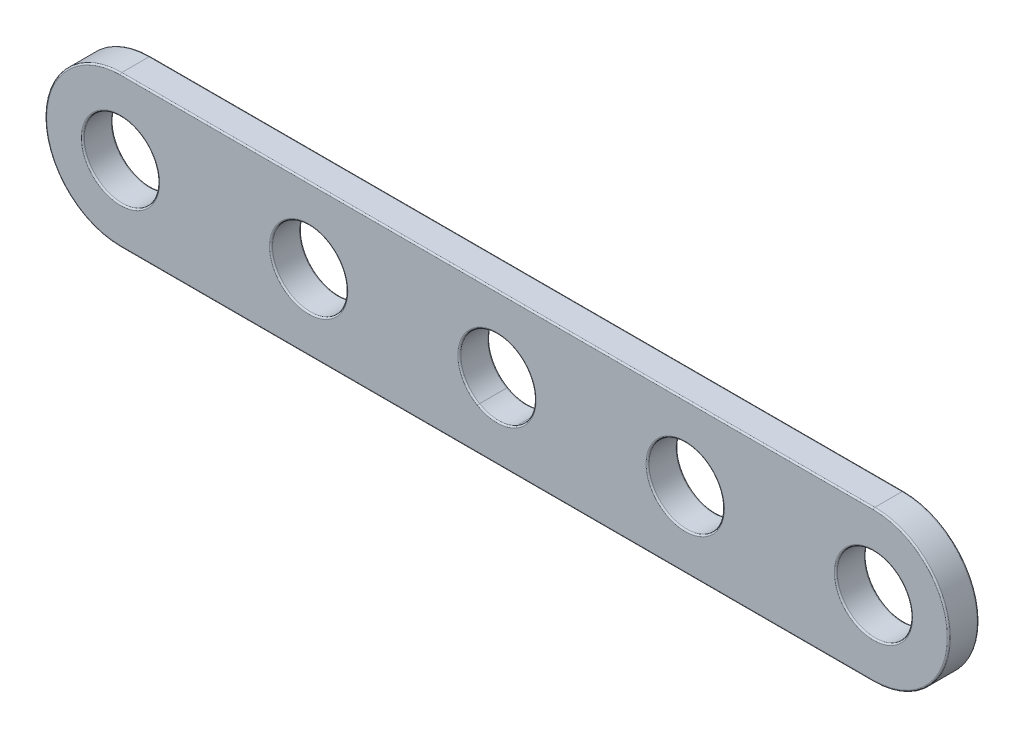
ISO-10303-21;
HEADER;
FILE_DESCRIPTION(('STEP AP214'),'2;1');
FILE_NAME('part.step','',(''),(''),'','','');
FILE_SCHEMA(('AUTOMOTIVE_DESIGN { 1 0 10303 214 1 1 1 1 }'));
ENDSEC;
DATA;
#1=APPLICATION_CONTEXT('core data for automotive mechanical design processes');
#2=APPLICATION_PROTOCOL_DEFINITION('international standard','automotive_design',2000,#1);
#3=PRODUCT_CONTEXT('',#1,'mechanical');
#4=PRODUCT('Part','Part','',(#3));
#5=PRODUCT_RELATED_PRODUCT_CATEGORY('part','',(#4));
#6=PRODUCT_DEFINITION_FORMATION('','',#4);
#7=PRODUCT_DEFINITION_CONTEXT('part definition',#1,'design');
#8=PRODUCT_DEFINITION('design','',#6,#7);
#9=PRODUCT_DEFINITION_SHAPE('','',#8);
#10=(LENGTH_UNIT() NAMED_UNIT(*) SI_UNIT(.MILLI.,.METRE.));
#11=(NAMED_UNIT(*) PLANE_ANGLE_UNIT() SI_UNIT($,.RADIAN.));
#12=(NAMED_UNIT(*) SI_UNIT($,.STERADIAN.) SOLID_ANGLE_UNIT());
#13=UNCERTAINTY_MEASURE_WITH_UNIT(LENGTH_MEASURE(1.E-05),#10,'distance_accuracy_value','');
#14=(GEOMETRIC_REPRESENTATION_CONTEXT(3) GLOBAL_UNCERTAINTY_ASSIGNED_CONTEXT((#13)) GLOBAL_UNIT_ASSIGNED_CONTEXT((#10,
#11,#12)) REPRESENTATION_CONTEXT('',''));
#15=CARTESIAN_POINT('',(0.,0.,0.));
#16=DIRECTION('',(0.,0.,1.));
#17=DIRECTION('',(1.,0.,0.));
#18=AXIS2_PLACEMENT_3D('',#15,#16,#17);
#19=CARTESIAN_POINT('',(250.,50.,0.));
#20=DIRECTION('',(0.,0.,1.));
#21=DIRECTION('',(1.,0.,0.));
#22=AXIS2_PLACEMENT_3D('',#19,#20,#21);
#23=CYLINDRICAL_SURFACE('',#22,25.);
#24=DIRECTION('',(0.,0.,1.));
#25=VECTOR('',#24,1.);
#26=CARTESIAN_POINT('',(262.5,28.349364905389,0.));
#27=LINE('',#26,#25);
#28=CARTESIAN_POINT('',(262.5,28.349364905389,19.));
#29=VERTEX_POINT('',#28);
#30=CARTESIAN_POINT('',(262.5,28.349364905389,1.));
#31=VERTEX_POINT('',#30);
#32=EDGE_CURVE('E343',#29,#31,#27,.F.);
#33=ORIENTED_EDGE('',*,*,#32,.F.);
#34=CARTESIAN_POINT('',(250.,50.,19.));
#35=DIRECTION('',(0.,0.,1.));
#36=DIRECTION('',(1.,0.,0.));
#37=AXIS2_PLACEMENT_3D('',#34,#35,#36);
#38=CIRCLE('',#37,25.);
#39=CARTESIAN_POINT('',(262.5,71.650635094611,19.));
#40=VERTEX_POINT('',#39);
#41=EDGE_CURVE('E236',#29,#40,#38,.T.);
#42=ORIENTED_EDGE('',*,*,#41,.T.);
#43=DIRECTION('',(0.,0.,1.));
#44=VECTOR('',#43,1.);
#45=CARTESIAN_POINT('',(262.5,71.650635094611,0.));
#46=LINE('',#45,#44);
#47=CARTESIAN_POINT('',(262.5,71.650635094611,1.));
#48=VERTEX_POINT('',#47);
#49=EDGE_CURVE('E337',#48,#40,#46,.T.);
#50=ORIENTED_EDGE('',*,*,#49,.F.);
#51=CARTESIAN_POINT('',(250.,50.,1.));
#52=DIRECTION('',(0.,0.,1.));
#53=DIRECTION('',(1.,0.,0.));
#54=AXIS2_PLACEMENT_3D('',#51,#52,#53);
#55=CIRCLE('',#54,25.);
#56=EDGE_CURVE('E233',#48,#31,#55,.F.);
#57=ORIENTED_EDGE('',*,*,#56,.T.);
#58=EDGE_LOOP('',(#33,#42,#50,#57));
#59=FACE_BOUND('',#58,.T.);
#60=ADVANCED_FACE('F36',(#59),#23,.F.);
#61=DIRECTION('',(0.,0.,1.));
#62=VECTOR('',#61,1.);
#63=CARTESIAN_POINT('',(237.5,28.349364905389,0.));
#64=LINE('',#63,#62);
#65=CARTESIAN_POINT('',(237.5,28.349364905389,1.));
#66=VERTEX_POINT('',#65);
#67=CARTESIAN_POINT('',(237.5,28.349364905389,19.));
#68=VERTEX_POINT('',#67);
#69=EDGE_CURVE('E331',#66,#68,#64,.T.);
#70=ORIENTED_EDGE('',*,*,#69,.T.);
#71=CARTESIAN_POINT('',(250.,50.,19.));
#72=DIRECTION('',(0.,0.,1.));
#73=DIRECTION('',(1.,0.,0.));
#74=AXIS2_PLACEMENT_3D('',#71,#72,#73);
#75=CIRCLE('',#74,25.);
#76=EDGE_CURVE('E231',#68,#29,#75,.T.);
#77=ORIENTED_EDGE('',*,*,#76,.T.);
#78=ORIENTED_EDGE('',*,*,#32,.T.);
#79=CARTESIAN_POINT('',(250.,50.,1.));
#80=DIRECTION('',(0.,0.,1.));
#81=DIRECTION('',(1.,0.,0.));
#82=AXIS2_PLACEMENT_3D('',#79,#80,#81);
#83=CIRCLE('',#82,25.);
#84=EDGE_CURVE('E229',#31,#66,#83,.F.);
#85=ORIENTED_EDGE('',*,*,#84,.T.);
#86=EDGE_LOOP('',(#70,#77,#78,#85));
#87=FACE_BOUND('',#86,.T.);
#88=ADVANCED_FACE('F365',(#87),#23,.F.);
#89=DIRECTION('',(0.,0.,1.));
#90=VECTOR('',#89,1.);
#91=CARTESIAN_POINT('',(237.5,71.650635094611,0.));
#92=LINE('',#91,#90);
#93=CARTESIAN_POINT('',(237.5,71.650635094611,19.));
#94=VERTEX_POINT('',#93);
#95=CARTESIAN_POINT('',(237.5,71.650635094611,1.));
#96=VERTEX_POINT('',#95);
#97=EDGE_CURVE('E329',#94,#96,#92,.F.);
#98=ORIENTED_EDGE('',*,*,#97,.F.);
#99=CARTESIAN_POINT('',(250.,50.,19.));
#100=DIRECTION('',(0.,0.,1.));
#101=DIRECTION('',(1.,0.,0.));
#102=AXIS2_PLACEMENT_3D('',#99,#100,#101);
#103=CIRCLE('',#102,25.);
#104=EDGE_CURVE('E157',#94,#68,#103,.T.);
#105=ORIENTED_EDGE('',*,*,#104,.T.);
#106=ORIENTED_EDGE('',*,*,#69,.F.);
#107=CARTESIAN_POINT('',(250.,50.,1.));
#108=DIRECTION('',(0.,0.,1.));
#109=DIRECTION('',(1.,0.,0.));
#110=AXIS2_PLACEMENT_3D('',#107,#108,#109);
#111=CIRCLE('',#110,25.);
#112=EDGE_CURVE('E226',#66,#96,#111,.F.);
#113=ORIENTED_EDGE('',*,*,#112,.T.);
#114=EDGE_LOOP('',(#98,#105,#106,#113));
#115=FACE_BOUND('',#114,.T.);
#116=ADVANCED_FACE('F328',(#115),#23,.F.);
#117=CARTESIAN_POINT('',(0.,50.,20.));
#118=DIRECTION('',(0.,0.,-1.));
#119=DIRECTION('',(-1.,0.,0.));
#120=AXIS2_PLACEMENT_3D('',#117,#118,#119);
#121=CYLINDRICAL_SURFACE('',#120,50.);
#122=DIRECTION('',(0.,0.,-1.));
#123=VECTOR('',#122,1.);
#124=CARTESIAN_POINT('',(0.,0.,20.));
#125=LINE('',#124,#123);
#126=CARTESIAN_POINT('',(0.,0.,19.));
#127=VERTEX_POINT('',#126);
#128=CARTESIAN_POINT('',(0.,0.,1.));
#129=VERTEX_POINT('',#128);
#130=EDGE_CURVE('E345',#127,#129,#125,.T.);
#131=ORIENTED_EDGE('',*,*,#130,.F.);
#132=CARTESIAN_POINT('',(0.,50.,19.));
#133=DIRECTION('',(0.,0.,1.));
#134=DIRECTION('',(1.,0.,0.));
#135=AXIS2_PLACEMENT_3D('',#132,#133,#134);
#136=CIRCLE('',#135,50.);
#137=CARTESIAN_POINT('',(0.,100.,19.));
#138=VERTEX_POINT('',#137);
#139=EDGE_CURVE('E212',#127,#138,#136,.F.);
#140=ORIENTED_EDGE('',*,*,#139,.T.);
#141=DIRECTION('',(0.,0.,-1.));
#142=VECTOR('',#141,1.);
#143=CARTESIAN_POINT('',(0.,100.,20.));
#144=LINE('',#143,#142);
#145=CARTESIAN_POINT('',(0.,100.,1.));
#146=VERTEX_POINT('',#145);
#147=EDGE_CURVE('E289',#138,#146,#144,.T.);
#148=ORIENTED_EDGE('',*,*,#147,.T.);
#149=CARTESIAN_POINT('',(0.,50.,1.));
#150=DIRECTION('',(0.,0.,1.));
#151=DIRECTION('',(1.,0.,0.));
#152=AXIS2_PLACEMENT_3D('',#149,#150,#151);
#153=CIRCLE('',#152,50.);
#154=EDGE_CURVE('E210',#146,#129,#153,.T.);
#155=ORIENTED_EDGE('',*,*,#154,.T.);
#156=EDGE_LOOP('',(#131,#140,#148,#155));
#157=FACE_BOUND('',#156,.T.);
#158=ADVANCED_FACE('F409',(#157),#121,.T.);
#159=CARTESIAN_POINT('',(0.,0.,20.));
#160=DIRECTION('',(0.,1.,0.));
#161=DIRECTION('',(0.,0.,1.));
#162=AXIS2_PLACEMENT_3D('',#159,#160,#161);
#163=PLANE('',#162);
#164=DIRECTION('',(0.,0.,-1.));
#165=VECTOR('',#164,1.);
#166=CARTESIAN_POINT('',(500.,0.,20.));
#167=LINE('',#166,#165);
#168=CARTESIAN_POINT('',(500.,0.,19.));
#169=VERTEX_POINT('',#168);
#170=CARTESIAN_POINT('',(500.,0.,1.));
#171=VERTEX_POINT('',#170);
#172=EDGE_CURVE('E717',#169,#171,#167,.T.);
#173=ORIENTED_EDGE('',*,*,#172,.F.);
#174=DIRECTION('',(1.,0.,0.));
#175=VECTOR('',#174,1.);
#176=CARTESIAN_POINT('',(0.,0.,19.));
#177=LINE('',#176,#175);
#178=EDGE_CURVE('E208',#169,#127,#177,.F.);
#179=ORIENTED_EDGE('',*,*,#178,.T.);
#180=ORIENTED_EDGE('',*,*,#130,.T.);
#181=DIRECTION('',(1.,0.,0.));
#182=VECTOR('',#181,1.);
#183=CARTESIAN_POINT('',(0.,0.,1.));
#184=LINE('',#183,#182);
#185=EDGE_CURVE('E205',#129,#171,#184,.T.);
#186=ORIENTED_EDGE('',*,*,#185,.T.);
#187=EDGE_LOOP('',(#173,#179,#180,#186));
#188=FACE_BOUND('',#187,.T.);
#189=ADVANCED_FACE('F413',(#188),#163,.F.);
#190=CARTESIAN_POINT('',(500.,50.,20.));
#191=DIRECTION('',(0.,0.,-1.));
#192=DIRECTION('',(-1.,0.,0.));
#193=AXIS2_PLACEMENT_3D('',#190,#191,#192);
#194=CYLINDRICAL_SURFACE('',#193,50.);
#195=DIRECTION('',(0.,0.,-1.));
#196=VECTOR('',#195,1.);
#197=CARTESIAN_POINT('',(500.,100.,20.));
#198=LINE('',#197,#196);
#199=CARTESIAN_POINT('',(500.,100.,19.));
#200=VERTEX_POINT('',#199);
#201=CARTESIAN_POINT('',(500.,100.,1.));
#202=VERTEX_POINT('',#201);
#203=EDGE_CURVE('E711',#200,#202,#198,.T.);
#204=ORIENTED_EDGE('',*,*,#203,.F.);
#205=CARTESIAN_POINT('',(500.,50.,19.));
#206=DIRECTION('',(0.,0.,1.));
#207=DIRECTION('',(1.,0.,0.));
#208=AXIS2_PLACEMENT_3D('',#205,#206,#207);
#209=CIRCLE('',#208,50.);
#210=EDGE_CURVE('E203',#200,#169,#209,.F.);
#211=ORIENTED_EDGE('',*,*,#210,.T.);
#212=ORIENTED_EDGE('',*,*,#172,.T.);
#213=CARTESIAN_POINT('',(500.,50.,1.));
#214=DIRECTION('',(0.,0.,1.));
#215=DIRECTION('',(1.,0.,0.));
#216=AXIS2_PLACEMENT_3D('',#213,#214,#215);
#217=CIRCLE('',#216,50.);
#218=EDGE_CURVE('E201',#171,#202,#217,.T.);
#219=ORIENTED_EDGE('',*,*,#218,.T.);
#220=EDGE_LOOP('',(#204,#211,#212,#219));
#221=FACE_BOUND('',#220,.T.);
#222=ADVANCED_FACE('F419',(#221),#194,.T.);
#223=CARTESIAN_POINT('',(0.,100.,20.));
#224=DIRECTION('',(0.,-1.,0.));
#225=DIRECTION('',(0.,0.,-1.));
#226=AXIS2_PLACEMENT_3D('',#223,#224,#225);
#227=PLANE('',#226);
#228=ORIENTED_EDGE('',*,*,#147,.F.);
#229=DIRECTION('',(-1.,0.,0.));
#230=VECTOR('',#229,1.);
#231=CARTESIAN_POINT('',(500.,100.,19.));
#232=LINE('',#231,#230);
#233=EDGE_CURVE('E198',#138,#200,#232,.F.);
#234=ORIENTED_EDGE('',*,*,#233,.T.);
#235=ORIENTED_EDGE('',*,*,#203,.T.);
#236=DIRECTION('',(-1.,0.,0.));
#237=VECTOR('',#236,1.);
#238=CARTESIAN_POINT('',(0.,100.,1.));
#239=LINE('',#238,#237);
#240=EDGE_CURVE('E196',#202,#146,#239,.T.);
#241=ORIENTED_EDGE('',*,*,#240,.T.);
#242=EDGE_LOOP('',(#228,#234,#235,#241));
#243=FACE_BOUND('',#242,.T.);
#244=ADVANCED_FACE('F675',(#243),#227,.F.);
#245=CARTESIAN_POINT('',(0.,50.,20.));
#246=DIRECTION('',(0.,0.,1.));
#247=DIRECTION('',(1.,0.,0.));
#248=AXIS2_PLACEMENT_3D('',#245,#246,#247);
#249=PLANE('',#248);
#250=CARTESIAN_POINT('',(500.,50.,20.));
#251=DIRECTION('',(0.,0.,1.));
#252=DIRECTION('',(1.,0.,0.));
#253=AXIS2_PLACEMENT_3D('',#250,#251,#252);
#254=CIRCLE('',#253,49.);
#255=CARTESIAN_POINT('',(500.,1.,20.));
#256=VERTEX_POINT('',#255);
#257=CARTESIAN_POINT('',(500.,99.,20.));
#258=VERTEX_POINT('',#257);
#259=EDGE_CURVE('E191',#256,#258,#254,.T.);
#260=ORIENTED_EDGE('',*,*,#259,.T.);
#261=DIRECTION('',(-1.,0.,0.));
#262=VECTOR('',#261,1.);
#263=CARTESIAN_POINT('',(0.,99.,20.));
#264=LINE('',#263,#262);
#265=CARTESIAN_POINT('',(0.,99.,20.));
#266=VERTEX_POINT('',#265);
#267=EDGE_CURVE('E193',#258,#266,#264,.T.);
#268=ORIENTED_EDGE('',*,*,#267,.T.);
#269=CARTESIAN_POINT('',(0.,50.,20.));
#270=DIRECTION('',(0.,0.,1.));
#271=DIRECTION('',(1.,0.,0.));
#272=AXIS2_PLACEMENT_3D('',#269,#270,#271);
#273=CIRCLE('',#272,49.);
#274=CARTESIAN_POINT('',(0.,1.,20.));
#275=VERTEX_POINT('',#274);
#276=EDGE_CURVE('E187',#266,#275,#273,.T.);
#277=ORIENTED_EDGE('',*,*,#276,.T.);
#278=DIRECTION('',(1.,0.,0.));
#279=VECTOR('',#278,1.);
#280=CARTESIAN_POINT('',(500.,1.,20.));
#281=LINE('',#280,#279);
#282=EDGE_CURVE('E189',#275,#256,#281,.T.);
#283=ORIENTED_EDGE('',*,*,#282,.T.);
#284=EDGE_LOOP('',(#260,#268,#277,#283));
#285=FACE_BOUND('',#284,.T.);
#286=CARTESIAN_POINT('',(0.,50.,20.));
#287=DIRECTION('',(0.,0.,1.));
#288=DIRECTION('',(1.,0.,0.));
#289=AXIS2_PLACEMENT_3D('',#286,#287,#288);
#290=CIRCLE('',#289,26.);
#291=CARTESIAN_POINT('',(26.,50.,20.));
#292=VERTEX_POINT('',#291);
#293=EDGE_CURVE('E180',#292,#292,#290,.F.);
#294=ORIENTED_EDGE('',*,*,#293,.T.);
#295=EDGE_LOOP('',(#294));
#296=FACE_BOUND('',#295,.T.);
#297=CARTESIAN_POINT('',(125.,50.,20.));
#298=DIRECTION('',(0.,0.,1.));
#299=DIRECTION('',(1.,0.,0.));
#300=AXIS2_PLACEMENT_3D('',#297,#298,#299);
#301=CIRCLE('',#300,26.);
#302=CARTESIAN_POINT('',(151.,50.,20.));
#303=VERTEX_POINT('',#302);
#304=EDGE_CURVE('E177',#303,#303,#301,.F.);
#305=ORIENTED_EDGE('',*,*,#304,.T.);
#306=EDGE_LOOP('',(#305));
#307=FACE_BOUND('',#306,.T.);
#308=CARTESIAN_POINT('',(250.,50.,20.));
#309=DIRECTION('',(0.,0.,1.));
#310=DIRECTION('',(1.,0.,0.));
#311=AXIS2_PLACEMENT_3D('',#308,#309,#310);
#312=CIRCLE('',#311,26.);
#313=CARTESIAN_POINT('',(263.,27.4833395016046,20.));
#314=VERTEX_POINT('',#313);
#315=CARTESIAN_POINT('',(237.,27.4833395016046,20.));
#316=VERTEX_POINT('',#315);
#317=EDGE_CURVE('E176',#314,#316,#312,.F.);
#318=ORIENTED_EDGE('',*,*,#317,.T.);
#319=CARTESIAN_POINT('',(250.,50.,20.));
#320=DIRECTION('',(0.,0.,1.));
#321=DIRECTION('',(1.,0.,0.));
#322=AXIS2_PLACEMENT_3D('',#319,#320,#321);
#323=CIRCLE('',#322,26.);
#324=CARTESIAN_POINT('',(237.,72.5166604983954,20.));
#325=VERTEX_POINT('',#324);
#326=EDGE_CURVE('E154',#316,#325,#323,.F.);
#327=ORIENTED_EDGE('',*,*,#326,.T.);
#328=CARTESIAN_POINT('',(250.,50.,20.));
#329=DIRECTION('',(0.,0.,1.));
#330=DIRECTION('',(1.,0.,0.));
#331=AXIS2_PLACEMENT_3D('',#328,#329,#330);
#332=CIRCLE('',#331,26.);
#333=CARTESIAN_POINT('',(263.,72.5166604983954,20.));
#334=VERTEX_POINT('',#333);
#335=EDGE_CURVE('E164',#325,#334,#332,.F.);
#336=ORIENTED_EDGE('',*,*,#335,.T.);
#337=CARTESIAN_POINT('',(250.,50.,20.));
#338=DIRECTION('',(0.,0.,1.));
#339=DIRECTION('',(1.,0.,0.));
#340=AXIS2_PLACEMENT_3D('',#337,#338,#339);
#341=CIRCLE('',#340,26.);
#342=EDGE_CURVE('E170',#334,#314,#341,.F.);
#343=ORIENTED_EDGE('',*,*,#342,.T.);
#344=EDGE_LOOP('',(#318,#327,#336,#343));
#345=FACE_BOUND('',#344,.T.);
#346=CARTESIAN_POINT('',(375.,50.,20.));
#347=DIRECTION('',(0.,0.,1.));
#348=DIRECTION('',(1.,0.,0.));
#349=AXIS2_PLACEMENT_3D('',#346,#347,#348);
#350=CIRCLE('',#349,26.);
#351=CARTESIAN_POINT('',(401.,50.,20.));
#352=VERTEX_POINT('',#351);
#353=EDGE_CURVE('E171',#352,#352,#350,.F.);
#354=ORIENTED_EDGE('',*,*,#353,.T.);
#355=EDGE_LOOP('',(#354));
#356=FACE_BOUND('',#355,.T.);
#357=CARTESIAN_POINT('',(500.,50.,20.));
#358=DIRECTION('',(0.,0.,1.));
#359=DIRECTION('',(1.,0.,0.));
#360=AXIS2_PLACEMENT_3D('',#357,#358,#359);
#361=CIRCLE('',#360,26.);
#362=CARTESIAN_POINT('',(526.,50.,20.));
#363=VERTEX_POINT('',#362);
#364=EDGE_CURVE('E352',#363,#363,#361,.F.);
#365=ORIENTED_EDGE('',*,*,#364,.T.);
#366=EDGE_LOOP('',(#365));
#367=FACE_BOUND('',#366,.T.);
#368=ADVANCED_FACE('F173',(#285,#296,#307,#345,#356,#367),#249,.T.);
#369=CARTESIAN_POINT('',(0.,50.,0.));
#370=DIRECTION('',(0.,0.,1.));
#371=DIRECTION('',(1.,0.,0.));
#372=AXIS2_PLACEMENT_3D('',#369,#370,#371);
#373=PLANE('',#372);
#374=CARTESIAN_POINT('',(500.,50.,0.));
#375=DIRECTION('',(0.,0.,1.));
#376=DIRECTION('',(1.,0.,0.));
#377=AXIS2_PLACEMENT_3D('',#374,#375,#376);
#378=CIRCLE('',#377,49.);
#379=CARTESIAN_POINT('',(500.,99.,0.));
#380=VERTEX_POINT('',#379);
#381=CARTESIAN_POINT('',(500.,1.,0.));
#382=VERTEX_POINT('',#381);
#383=EDGE_CURVE('E45',#380,#382,#378,.F.);
#384=ORIENTED_EDGE('',*,*,#383,.T.);
#385=DIRECTION('',(1.,0.,0.));
#386=VECTOR('',#385,1.);
#387=CARTESIAN_POINT('',(0.,1.,0.));
#388=LINE('',#387,#386);
#389=CARTESIAN_POINT('',(0.,1.,0.));
#390=VERTEX_POINT('',#389);
#391=EDGE_CURVE('E12',#382,#390,#388,.F.);
#392=ORIENTED_EDGE('',*,*,#391,.T.);
#393=CARTESIAN_POINT('',(0.,50.,0.));
#394=DIRECTION('',(0.,0.,1.));
#395=DIRECTION('',(1.,0.,0.));
#396=AXIS2_PLACEMENT_3D('',#393,#394,#395);
#397=CIRCLE('',#396,49.);
#398=CARTESIAN_POINT('',(0.,99.,0.));
#399=VERTEX_POINT('',#398);
#400=EDGE_CURVE('E275',#390,#399,#397,.F.);
#401=ORIENTED_EDGE('',*,*,#400,.T.);
#402=DIRECTION('',(-1.,0.,0.));
#403=VECTOR('',#402,1.);
#404=CARTESIAN_POINT('',(0.,99.,0.));
#405=LINE('',#404,#403);
#406=EDGE_CURVE('E56',#399,#380,#405,.F.);
#407=ORIENTED_EDGE('',*,*,#406,.T.);
#408=EDGE_LOOP('',(#384,#392,#401,#407));
#409=FACE_BOUND('',#408,.T.);
#410=CARTESIAN_POINT('',(0.,50.,0.));
#411=DIRECTION('',(0.,0.,1.));
#412=DIRECTION('',(1.,0.,0.));
#413=AXIS2_PLACEMENT_3D('',#410,#411,#412);
#414=CIRCLE('',#413,26.);
#415=CARTESIAN_POINT('',(26.,50.,0.));
#416=VERTEX_POINT('',#415);
#417=EDGE_CURVE('E272',#416,#416,#414,.T.);
#418=ORIENTED_EDGE('',*,*,#417,.T.);
#419=EDGE_LOOP('',(#418));
#420=FACE_BOUND('',#419,.T.);
#421=CARTESIAN_POINT('',(125.,50.,0.));
#422=DIRECTION('',(0.,0.,1.));
#423=DIRECTION('',(1.,0.,0.));
#424=AXIS2_PLACEMENT_3D('',#421,#422,#423);
#425=CIRCLE('',#424,26.);
#426=CARTESIAN_POINT('',(151.,50.,0.));
#427=VERTEX_POINT('',#426);
#428=EDGE_CURVE('E269',#427,#427,#425,.T.);
#429=ORIENTED_EDGE('',*,*,#428,.T.);
#430=EDGE_LOOP('',(#429));
#431=FACE_BOUND('',#430,.T.);
#432=CARTESIAN_POINT('',(250.,50.,0.));
#433=DIRECTION('',(0.,0.,1.));
#434=DIRECTION('',(1.,0.,0.));
#435=AXIS2_PLACEMENT_3D('',#432,#433,#434);
#436=CIRCLE('',#435,26.);
#437=CARTESIAN_POINT('',(237.,27.4833395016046,0.));
#438=VERTEX_POINT('',#437);
#439=CARTESIAN_POINT('',(263.,27.4833395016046,0.));
#440=VERTEX_POINT('',#439);
#441=EDGE_CURVE('E264',#438,#440,#436,.T.);
#442=ORIENTED_EDGE('',*,*,#441,.T.);
#443=CARTESIAN_POINT('',(250.,50.,0.));
#444=DIRECTION('',(0.,0.,1.));
#445=DIRECTION('',(1.,0.,0.));
#446=AXIS2_PLACEMENT_3D('',#443,#444,#445);
#447=CIRCLE('',#446,26.);
#448=CARTESIAN_POINT('',(263.,72.5166604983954,0.));
#449=VERTEX_POINT('',#448);
#450=EDGE_CURVE('E266',#440,#449,#447,.T.);
#451=ORIENTED_EDGE('',*,*,#450,.T.);
#452=CARTESIAN_POINT('',(250.,50.,0.));
#453=DIRECTION('',(0.,0.,1.));
#454=DIRECTION('',(1.,0.,0.));
#455=AXIS2_PLACEMENT_3D('',#452,#453,#454);
#456=CIRCLE('',#455,26.);
#457=CARTESIAN_POINT('',(237.,72.5166604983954,0.));
#458=VERTEX_POINT('',#457);
#459=EDGE_CURVE('E260',#449,#458,#456,.T.);
#460=ORIENTED_EDGE('',*,*,#459,.T.);
#461=CARTESIAN_POINT('',(250.,50.,0.));
#462=DIRECTION('',(0.,0.,1.));
#463=DIRECTION('',(1.,0.,0.));
#464=AXIS2_PLACEMENT_3D('',#461,#462,#463);
#465=CIRCLE('',#464,26.);
#466=EDGE_CURVE('E262',#458,#438,#465,.T.);
#467=ORIENTED_EDGE('',*,*,#466,.T.);
#468=EDGE_LOOP('',(#442,#451,#460,#467));
#469=FACE_BOUND('',#468,.T.);
#470=CARTESIAN_POINT('',(375.,50.,0.));
#471=DIRECTION('',(0.,0.,1.));
#472=DIRECTION('',(1.,0.,0.));
#473=AXIS2_PLACEMENT_3D('',#470,#471,#472);
#474=CIRCLE('',#473,26.);
#475=CARTESIAN_POINT('',(401.,50.,0.));
#476=VERTEX_POINT('',#475);
#477=EDGE_CURVE('E257',#476,#476,#474,.T.);
#478=ORIENTED_EDGE('',*,*,#477,.T.);
#479=EDGE_LOOP('',(#478));
#480=FACE_BOUND('',#479,.T.);
#481=CARTESIAN_POINT('',(500.,50.,0.));
#482=DIRECTION('',(0.,0.,1.));
#483=DIRECTION('',(1.,0.,0.));
#484=AXIS2_PLACEMENT_3D('',#481,#482,#483);
#485=CIRCLE('',#484,26.);
#486=CARTESIAN_POINT('',(526.,50.,0.));
#487=VERTEX_POINT('',#486);
#488=EDGE_CURVE('E254',#487,#487,#485,.T.);
#489=ORIENTED_EDGE('',*,*,#488,.T.);
#490=EDGE_LOOP('',(#489));
#491=FACE_BOUND('',#490,.T.);
#492=ADVANCED_FACE('F374',(#409,#420,#431,#469,#480,#491),#373,.F.);
#493=CARTESIAN_POINT('',(0.,50.,0.));
#494=DIRECTION('',(0.,0.,1.));
#495=DIRECTION('',(1.,0.,0.));
#496=AXIS2_PLACEMENT_3D('',#493,#494,#495);
#497=CYLINDRICAL_SURFACE('',#496,25.);
#498=CARTESIAN_POINT('',(0.,50.,19.));
#499=DIRECTION('',(0.,0.,1.));
#500=DIRECTION('',(1.,0.,0.));
#501=AXIS2_PLACEMENT_3D('',#498,#499,#500);
#502=CIRCLE('',#501,25.);
#503=CARTESIAN_POINT('',(25.,50.,19.));
#504=VERTEX_POINT('',#503);
#505=EDGE_CURVE('E217',#504,#504,#502,.T.);
#506=ORIENTED_EDGE('',*,*,#505,.T.);
#507=EDGE_LOOP('',(#506));
#508=FACE_BOUND('',#507,.T.);
#509=CARTESIAN_POINT('',(0.,50.,1.));
#510=DIRECTION('',(0.,0.,1.));
#511=DIRECTION('',(1.,0.,0.));
#512=AXIS2_PLACEMENT_3D('',#509,#510,#511);
#513=CIRCLE('',#512,25.);
#514=CARTESIAN_POINT('',(25.,50.,1.));
#515=VERTEX_POINT('',#514);
#516=EDGE_CURVE('E214',#515,#515,#513,.F.);
#517=ORIENTED_EDGE('',*,*,#516,.T.);
#518=EDGE_LOOP('',(#517));
#519=FACE_BOUND('',#518,.T.);
#520=ADVANCED_FACE('F377',(#508,#519),#497,.F.);
#521=CARTESIAN_POINT('',(125.,50.,0.));
#522=DIRECTION('',(0.,0.,1.));
#523=DIRECTION('',(1.,0.,0.));
#524=AXIS2_PLACEMENT_3D('',#521,#522,#523);
#525=CYLINDRICAL_SURFACE('',#524,25.);
#526=CARTESIAN_POINT('',(125.,50.,19.));
#527=DIRECTION('',(0.,0.,1.));
#528=DIRECTION('',(1.,0.,0.));
#529=AXIS2_PLACEMENT_3D('',#526,#527,#528);
#530=CIRCLE('',#529,25.);
#531=CARTESIAN_POINT('',(150.,50.,19.));
#532=VERTEX_POINT('',#531);
#533=EDGE_CURVE('E223',#532,#532,#530,.T.);
#534=ORIENTED_EDGE('',*,*,#533,.T.);
#535=EDGE_LOOP('',(#534));
#536=FACE_BOUND('',#535,.T.);
#537=CARTESIAN_POINT('',(125.,50.,1.));
#538=DIRECTION('',(0.,0.,1.));
#539=DIRECTION('',(1.,0.,0.));
#540=AXIS2_PLACEMENT_3D('',#537,#538,#539);
#541=CIRCLE('',#540,25.);
#542=CARTESIAN_POINT('',(150.,50.,1.));
#543=VERTEX_POINT('',#542);
#544=EDGE_CURVE('E220',#543,#543,#541,.F.);
#545=ORIENTED_EDGE('',*,*,#544,.T.);
#546=EDGE_LOOP('',(#545));
#547=FACE_BOUND('',#546,.T.);
#548=ADVANCED_FACE('F400',(#536,#547),#525,.F.);
#549=ORIENTED_EDGE('',*,*,#49,.T.);
#550=CARTESIAN_POINT('',(250.,50.,19.));
#551=DIRECTION('',(0.,0.,1.));
#552=DIRECTION('',(1.,0.,0.));
#553=AXIS2_PLACEMENT_3D('',#550,#551,#552);
#554=CIRCLE('',#553,25.);
#555=EDGE_CURVE('E240',#40,#94,#554,.T.);
#556=ORIENTED_EDGE('',*,*,#555,.T.);
#557=ORIENTED_EDGE('',*,*,#97,.T.);
#558=CARTESIAN_POINT('',(250.,50.,1.));
#559=DIRECTION('',(0.,0.,1.));
#560=DIRECTION('',(1.,0.,0.));
#561=AXIS2_PLACEMENT_3D('',#558,#559,#560);
#562=CIRCLE('',#561,25.);
#563=EDGE_CURVE('E238',#96,#48,#562,.F.);
#564=ORIENTED_EDGE('',*,*,#563,.T.);
#565=EDGE_LOOP('',(#549,#556,#557,#564));
#566=FACE_BOUND('',#565,.T.);
#567=ADVANCED_FACE('F334',(#566),#23,.F.);
#568=CARTESIAN_POINT('',(375.,50.,0.));
#569=DIRECTION('',(0.,0.,1.));
#570=DIRECTION('',(1.,0.,0.));
#571=AXIS2_PLACEMENT_3D('',#568,#569,#570);
#572=CYLINDRICAL_SURFACE('',#571,25.);
#573=CARTESIAN_POINT('',(375.,50.,19.));
#574=DIRECTION('',(0.,0.,1.));
#575=DIRECTION('',(1.,0.,0.));
#576=AXIS2_PLACEMENT_3D('',#573,#574,#575);
#577=CIRCLE('',#576,25.);
#578=CARTESIAN_POINT('',(400.,50.,19.));
#579=VERTEX_POINT('',#578);
#580=EDGE_CURVE('E245',#579,#579,#577,.T.);
#581=ORIENTED_EDGE('',*,*,#580,.T.);
#582=EDGE_LOOP('',(#581));
#583=FACE_BOUND('',#582,.T.);
#584=CARTESIAN_POINT('',(375.,50.,1.));
#585=DIRECTION('',(0.,0.,1.));
#586=DIRECTION('',(1.,0.,0.));
#587=AXIS2_PLACEMENT_3D('',#584,#585,#586);
#588=CIRCLE('',#587,25.);
#589=CARTESIAN_POINT('',(400.,50.,1.));
#590=VERTEX_POINT('',#589);
#591=EDGE_CURVE('E242',#590,#590,#588,.F.);
#592=ORIENTED_EDGE('',*,*,#591,.T.);
#593=EDGE_LOOP('',(#592));
#594=FACE_BOUND('',#593,.T.);
#595=ADVANCED_FACE('F399',(#583,#594),#572,.F.);
#596=CARTESIAN_POINT('',(500.,50.,0.));
#597=DIRECTION('',(0.,0.,1.));
#598=DIRECTION('',(1.,0.,0.));
#599=AXIS2_PLACEMENT_3D('',#596,#597,#598);
#600=CYLINDRICAL_SURFACE('',#599,25.);
#601=CARTESIAN_POINT('',(500.,50.,19.));
#602=DIRECTION('',(0.,0.,1.));
#603=DIRECTION('',(1.,0.,0.));
#604=AXIS2_PLACEMENT_3D('',#601,#602,#603);
#605=CIRCLE('',#604,25.);
#606=CARTESIAN_POINT('',(525.,50.,19.));
#607=VERTEX_POINT('',#606);
#608=EDGE_CURVE('E251',#607,#607,#605,.T.);
#609=ORIENTED_EDGE('',*,*,#608,.T.);
#610=EDGE_LOOP('',(#609));
#611=FACE_BOUND('',#610,.T.);
#612=CARTESIAN_POINT('',(500.,50.,1.));
#613=DIRECTION('',(0.,0.,1.));
#614=DIRECTION('',(1.,0.,0.));
#615=AXIS2_PLACEMENT_3D('',#612,#613,#614);
#616=CIRCLE('',#615,25.);
#617=CARTESIAN_POINT('',(525.,50.,1.));
#618=VERTEX_POINT('',#617);
#619=EDGE_CURVE('E248',#618,#618,#616,.F.);
#620=ORIENTED_EDGE('',*,*,#619,.T.);
#621=EDGE_LOOP('',(#620));
#622=FACE_BOUND('',#621,.T.);
#623=ADVANCED_FACE('F405',(#611,#622),#600,.F.);
#624=CARTESIAN_POINT('',(0.,1.,19.));
#625=DIRECTION('',(-1.,0.,0.));
#626=DIRECTION('',(0.,0.,1.));
#627=AXIS2_PLACEMENT_3D('',#624,#625,#626);
#628=CYLINDRICAL_SURFACE('',#627,1.);
#629=CARTESIAN_POINT('',(0.,1.,19.));
#630=DIRECTION('',(-1.,0.,0.));
#631=DIRECTION('',(0.,0.,1.));
#632=AXIS2_PLACEMENT_3D('',#629,#630,#631);
#633=CIRCLE('',#632,1.);
#634=EDGE_CURVE('E283',#127,#275,#633,.T.);
#635=ORIENTED_EDGE('',*,*,#634,.F.);
#636=ORIENTED_EDGE('',*,*,#178,.F.);
#637=CARTESIAN_POINT('',(500.,1.,19.));
#638=DIRECTION('',(1.,0.,0.));
#639=DIRECTION('',(0.,0.,-1.));
#640=AXIS2_PLACEMENT_3D('',#637,#638,#639);
#641=CIRCLE('',#640,1.);
#642=EDGE_CURVE('E286',#256,#169,#641,.T.);
#643=ORIENTED_EDGE('',*,*,#642,.F.);
#644=ORIENTED_EDGE('',*,*,#282,.F.);
#645=EDGE_LOOP('',(#635,#636,#643,#644));
#646=FACE_BOUND('',#645,.T.);
#647=ADVANCED_FACE('F437',(#646),#628,.T.);
#648=CARTESIAN_POINT('',(500.,50.,19.));
#649=DIRECTION('',(0.,0.,1.));
#650=DIRECTION('',(1.,0.,0.));
#651=AXIS2_PLACEMENT_3D('',#648,#649,#650);
#652=TOROIDAL_SURFACE('',#651,49.,1.);
#653=ORIENTED_EDGE('',*,*,#642,.T.);
#654=ORIENTED_EDGE('',*,*,#210,.F.);
#655=CARTESIAN_POINT('',(500.,99.,19.));
#656=DIRECTION('',(-1.,0.,0.));
#657=DIRECTION('',(0.,0.,1.));
#658=AXIS2_PLACEMENT_3D('',#655,#656,#657);
#659=CIRCLE('',#658,1.);
#660=EDGE_CURVE('E281',#258,#200,#659,.T.);
#661=ORIENTED_EDGE('',*,*,#660,.F.);
#662=ORIENTED_EDGE('',*,*,#259,.F.);
#663=EDGE_LOOP('',(#653,#654,#661,#662));
#664=FACE_BOUND('',#663,.T.);
#665=ADVANCED_FACE('F433',(#664),#652,.T.);
#666=CARTESIAN_POINT('',(0.,50.,19.));
#667=DIRECTION('',(0.,0.,1.));
#668=DIRECTION('',(1.,0.,0.));
#669=AXIS2_PLACEMENT_3D('',#666,#667,#668);
#670=TOROIDAL_SURFACE('',#669,49.,1.);
#671=ORIENTED_EDGE('',*,*,#634,.T.);
#672=ORIENTED_EDGE('',*,*,#276,.F.);
#673=CARTESIAN_POINT('',(0.,99.,19.));
#674=DIRECTION('',(1.,0.,0.));
#675=DIRECTION('',(0.,0.,-1.));
#676=AXIS2_PLACEMENT_3D('',#673,#674,#675);
#677=CIRCLE('',#676,1.);
#678=EDGE_CURVE('E279',#138,#266,#677,.T.);
#679=ORIENTED_EDGE('',*,*,#678,.F.);
#680=ORIENTED_EDGE('',*,*,#139,.F.);
#681=EDGE_LOOP('',(#671,#672,#679,#680));
#682=FACE_BOUND('',#681,.T.);
#683=ADVANCED_FACE('F429',(#682),#670,.T.);
#684=CARTESIAN_POINT('',(0.,99.,19.));
#685=DIRECTION('',(1.,0.,0.));
#686=DIRECTION('',(0.,0.,-1.));
#687=AXIS2_PLACEMENT_3D('',#684,#685,#686);
#688=CYLINDRICAL_SURFACE('',#687,1.);
#689=ORIENTED_EDGE('',*,*,#660,.T.);
#690=ORIENTED_EDGE('',*,*,#233,.F.);
#691=ORIENTED_EDGE('',*,*,#678,.T.);
#692=ORIENTED_EDGE('',*,*,#267,.F.);
#693=EDGE_LOOP('',(#689,#690,#691,#692));
#694=FACE_BOUND('',#693,.T.);
#695=ADVANCED_FACE('F425',(#694),#688,.T.);
#696=CARTESIAN_POINT('',(0.,50.,19.));
#697=DIRECTION('',(0.,0.,1.));
#698=DIRECTION('',(1.,0.,0.));
#699=AXIS2_PLACEMENT_3D('',#696,#697,#698);
#700=TOROIDAL_SURFACE('',#699,26.,1.);
#701=ORIENTED_EDGE('',*,*,#293,.F.);
#702=EDGE_LOOP('',(#701));
#703=FACE_BOUND('',#702,.T.);
#704=ORIENTED_EDGE('',*,*,#505,.F.);
#705=EDGE_LOOP('',(#704));
#706=FACE_BOUND('',#705,.T.);
#707=ADVANCED_FACE('F428',(#703,#706),#700,.T.);
#708=CARTESIAN_POINT('',(125.,50.,19.));
#709=DIRECTION('',(0.,0.,1.));
#710=DIRECTION('',(1.,0.,0.));
#711=AXIS2_PLACEMENT_3D('',#708,#709,#710);
#712=TOROIDAL_SURFACE('',#711,26.,1.);
#713=ORIENTED_EDGE('',*,*,#304,.F.);
#714=EDGE_LOOP('',(#713));
#715=FACE_BOUND('',#714,.T.);
#716=ORIENTED_EDGE('',*,*,#533,.F.);
#717=EDGE_LOOP('',(#716));
#718=FACE_BOUND('',#717,.T.);
#719=ADVANCED_FACE('F444',(#715,#718),#712,.T.);
#720=CARTESIAN_POINT('',(250.,50.,19.));
#721=DIRECTION('',(0.,0.,1.));
#722=DIRECTION('',(1.,0.,0.));
#723=AXIS2_PLACEMENT_3D('',#720,#721,#722);
#724=TOROIDAL_SURFACE('',#723,26.,1.);
#725=CARTESIAN_POINT('',(263.,27.4833395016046,19.));
#726=DIRECTION('',(-0.866025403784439,-0.5,0.));
#727=DIRECTION('',(0.5,-0.866025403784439,0.));
#728=AXIS2_PLACEMENT_3D('',#725,#726,#727);
#729=CIRCLE('',#728,1.);
#730=EDGE_CURVE('E160',#314,#29,#729,.T.);
#731=ORIENTED_EDGE('',*,*,#730,.F.);
#732=ORIENTED_EDGE('',*,*,#342,.F.);
#733=CARTESIAN_POINT('',(263.,72.5166604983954,19.));
#734=DIRECTION('',(-0.866025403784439,0.499999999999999,0.));
#735=DIRECTION('',(-0.499999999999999,-0.86602540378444,0.));
#736=AXIS2_PLACEMENT_3D('',#733,#734,#735);
#737=CIRCLE('',#736,1.);
#738=EDGE_CURVE('E167',#40,#334,#737,.T.);
#739=ORIENTED_EDGE('',*,*,#738,.F.);
#740=ORIENTED_EDGE('',*,*,#41,.F.);
#741=EDGE_LOOP('',(#731,#732,#739,#740));
#742=FACE_BOUND('',#741,.T.);
#743=ADVANCED_FACE('F359',(#742),#724,.T.);
#744=CARTESIAN_POINT('',(250.,50.,19.));
#745=DIRECTION('',(0.,0.,1.));
#746=DIRECTION('',(1.,0.,0.));
#747=AXIS2_PLACEMENT_3D('',#744,#745,#746);
#748=TOROIDAL_SURFACE('',#747,26.,1.);
#749=ORIENTED_EDGE('',*,*,#738,.T.);
#750=ORIENTED_EDGE('',*,*,#335,.F.);
#751=CARTESIAN_POINT('',(237.,72.5166604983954,19.));
#752=DIRECTION('',(-0.866025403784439,-0.499999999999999,0.));
#753=DIRECTION('',(0.499999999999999,-0.86602540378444,0.));
#754=AXIS2_PLACEMENT_3D('',#751,#752,#753);
#755=CIRCLE('',#754,1.);
#756=EDGE_CURVE('E150',#94,#325,#755,.T.);
#757=ORIENTED_EDGE('',*,*,#756,.F.);
#758=ORIENTED_EDGE('',*,*,#555,.F.);
#759=EDGE_LOOP('',(#749,#750,#757,#758));
#760=FACE_BOUND('',#759,.T.);
#761=ADVANCED_FACE('F165',(#760),#748,.T.);
#762=CARTESIAN_POINT('',(250.,50.,19.));
#763=DIRECTION('',(0.,0.,1.));
#764=DIRECTION('',(1.,0.,0.));
#765=AXIS2_PLACEMENT_3D('',#762,#763,#764);
#766=TOROIDAL_SURFACE('',#765,26.,1.);
#767=ORIENTED_EDGE('',*,*,#730,.T.);
#768=ORIENTED_EDGE('',*,*,#76,.F.);
#769=CARTESIAN_POINT('',(237.,27.4833395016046,19.));
#770=DIRECTION('',(-0.866025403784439,0.5,0.));
#771=DIRECTION('',(-0.5,-0.866025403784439,0.));
#772=AXIS2_PLACEMENT_3D('',#769,#770,#771);
#773=CIRCLE('',#772,1.);
#774=EDGE_CURVE('E161',#316,#68,#773,.T.);
#775=ORIENTED_EDGE('',*,*,#774,.F.);
#776=ORIENTED_EDGE('',*,*,#317,.F.);
#777=EDGE_LOOP('',(#767,#768,#775,#776));
#778=FACE_BOUND('',#777,.T.);
#779=ADVANCED_FACE('F362',(#778),#766,.T.);
#780=CARTESIAN_POINT('',(250.,50.,19.));
#781=DIRECTION('',(0.,0.,1.));
#782=DIRECTION('',(1.,0.,0.));
#783=AXIS2_PLACEMENT_3D('',#780,#781,#782);
#784=TOROIDAL_SURFACE('',#783,26.,1.);
#785=ORIENTED_EDGE('',*,*,#756,.T.);
#786=ORIENTED_EDGE('',*,*,#326,.F.);
#787=ORIENTED_EDGE('',*,*,#774,.T.);
#788=ORIENTED_EDGE('',*,*,#104,.F.);
#789=EDGE_LOOP('',(#785,#786,#787,#788));
#790=FACE_BOUND('',#789,.T.);
#791=ADVANCED_FACE('F152',(#790),#784,.T.);
#792=CARTESIAN_POINT('',(375.,50.,19.));
#793=DIRECTION('',(0.,0.,1.));
#794=DIRECTION('',(1.,0.,0.));
#795=AXIS2_PLACEMENT_3D('',#792,#793,#794);
#796=TOROIDAL_SURFACE('',#795,26.,1.);
#797=ORIENTED_EDGE('',*,*,#353,.F.);
#798=EDGE_LOOP('',(#797));
#799=FACE_BOUND('',#798,.T.);
#800=ORIENTED_EDGE('',*,*,#580,.F.);
#801=EDGE_LOOP('',(#800));
#802=FACE_BOUND('',#801,.T.);
#803=ADVANCED_FACE('F451',(#799,#802),#796,.T.);
#804=CARTESIAN_POINT('',(500.,50.,19.));
#805=DIRECTION('',(0.,0.,1.));
#806=DIRECTION('',(1.,0.,0.));
#807=AXIS2_PLACEMENT_3D('',#804,#805,#806);
#808=TOROIDAL_SURFACE('',#807,26.,1.);
#809=ORIENTED_EDGE('',*,*,#364,.F.);
#810=EDGE_LOOP('',(#809));
#811=FACE_BOUND('',#810,.T.);
#812=ORIENTED_EDGE('',*,*,#608,.F.);
#813=EDGE_LOOP('',(#812));
#814=FACE_BOUND('',#813,.T.);
#815=ADVANCED_FACE('F460',(#811,#814),#808,.T.);
#816=CARTESIAN_POINT('',(0.,99.,1.));
#817=DIRECTION('',(-1.,0.,0.));
#818=DIRECTION('',(0.,0.,1.));
#819=AXIS2_PLACEMENT_3D('',#816,#817,#818);
#820=CYLINDRICAL_SURFACE('',#819,1.);
#821=CARTESIAN_POINT('',(500.,99.,1.));
#822=DIRECTION('',(1.,0.,0.));
#823=DIRECTION('',(0.,0.,-1.));
#824=AXIS2_PLACEMENT_3D('',#821,#822,#823);
#825=CIRCLE('',#824,1.);
#826=EDGE_CURVE('E299',#380,#202,#825,.T.);
#827=ORIENTED_EDGE('',*,*,#826,.F.);
#828=ORIENTED_EDGE('',*,*,#406,.F.);
#829=CARTESIAN_POINT('',(0.,99.,1.));
#830=DIRECTION('',(-1.,0.,0.));
#831=DIRECTION('',(0.,0.,1.));
#832=AXIS2_PLACEMENT_3D('',#829,#830,#831);
#833=CIRCLE('',#832,1.);
#834=EDGE_CURVE('E290',#146,#399,#833,.T.);
#835=ORIENTED_EDGE('',*,*,#834,.F.);
#836=ORIENTED_EDGE('',*,*,#240,.F.);
#837=EDGE_LOOP('',(#827,#828,#835,#836));
#838=FACE_BOUND('',#837,.T.);
#839=ADVANCED_FACE('F464',(#838),#820,.T.);
#840=CARTESIAN_POINT('',(0.,50.,1.));
#841=DIRECTION('',(0.,0.,1.));
#842=DIRECTION('',(1.,0.,0.));
#843=AXIS2_PLACEMENT_3D('',#840,#841,#842);
#844=TOROIDAL_SURFACE('',#843,49.,1.);
#845=ORIENTED_EDGE('',*,*,#834,.T.);
#846=ORIENTED_EDGE('',*,*,#400,.F.);
#847=CARTESIAN_POINT('',(0.,1.,1.));
#848=DIRECTION('',(1.,0.,0.));
#849=DIRECTION('',(0.,0.,-1.));
#850=AXIS2_PLACEMENT_3D('',#847,#848,#849);
#851=CIRCLE('',#850,1.);
#852=EDGE_CURVE('E297',#129,#390,#851,.T.);
#853=ORIENTED_EDGE('',*,*,#852,.F.);
#854=ORIENTED_EDGE('',*,*,#154,.F.);
#855=EDGE_LOOP('',(#845,#846,#853,#854));
#856=FACE_BOUND('',#855,.T.);
#857=ADVANCED_FACE('F474',(#856),#844,.T.);
#858=CARTESIAN_POINT('',(500.,50.,1.));
#859=DIRECTION('',(0.,0.,1.));
#860=DIRECTION('',(1.,0.,0.));
#861=AXIS2_PLACEMENT_3D('',#858,#859,#860);
#862=TOROIDAL_SURFACE('',#861,49.,1.);
#863=ORIENTED_EDGE('',*,*,#826,.T.);
#864=ORIENTED_EDGE('',*,*,#218,.F.);
#865=CARTESIAN_POINT('',(500.,1.,1.));
#866=DIRECTION('',(-1.,0.,0.));
#867=DIRECTION('',(0.,0.,1.));
#868=AXIS2_PLACEMENT_3D('',#865,#866,#867);
#869=CIRCLE('',#868,1.);
#870=EDGE_CURVE('E295',#382,#171,#869,.T.);
#871=ORIENTED_EDGE('',*,*,#870,.F.);
#872=ORIENTED_EDGE('',*,*,#383,.F.);
#873=EDGE_LOOP('',(#863,#864,#871,#872));
#874=FACE_BOUND('',#873,.T.);
#875=ADVANCED_FACE('F470',(#874),#862,.T.);
#876=CARTESIAN_POINT('',(0.,1.,1.));
#877=DIRECTION('',(1.,0.,0.));
#878=DIRECTION('',(0.,0.,-1.));
#879=AXIS2_PLACEMENT_3D('',#876,#877,#878);
#880=CYLINDRICAL_SURFACE('',#879,1.);
#881=ORIENTED_EDGE('',*,*,#852,.T.);
#882=ORIENTED_EDGE('',*,*,#391,.F.);
#883=ORIENTED_EDGE('',*,*,#870,.T.);
#884=ORIENTED_EDGE('',*,*,#185,.F.);
#885=EDGE_LOOP('',(#881,#882,#883,#884));
#886=FACE_BOUND('',#885,.T.);
#887=ADVANCED_FACE('F466',(#886),#880,.T.);
#888=CARTESIAN_POINT('',(0.,50.,1.));
#889=DIRECTION('',(0.,0.,1.));
#890=DIRECTION('',(1.,0.,0.));
#891=AXIS2_PLACEMENT_3D('',#888,#889,#890);
#892=TOROIDAL_SURFACE('',#891,26.,1.);
#893=ORIENTED_EDGE('',*,*,#516,.F.);
#894=EDGE_LOOP('',(#893));
#895=FACE_BOUND('',#894,.T.);
#896=ORIENTED_EDGE('',*,*,#417,.F.);
#897=EDGE_LOOP('',(#896));
#898=FACE_BOUND('',#897,.T.);
#899=ADVANCED_FACE('F469',(#895,#898),#892,.T.);
#900=CARTESIAN_POINT('',(125.,50.,1.));
#901=DIRECTION('',(0.,0.,1.));
#902=DIRECTION('',(1.,0.,0.));
#903=AXIS2_PLACEMENT_3D('',#900,#901,#902);
#904=TOROIDAL_SURFACE('',#903,26.,1.);
#905=ORIENTED_EDGE('',*,*,#544,.F.);
#906=EDGE_LOOP('',(#905));
#907=FACE_BOUND('',#906,.T.);
#908=ORIENTED_EDGE('',*,*,#428,.F.);
#909=EDGE_LOOP('',(#908));
#910=FACE_BOUND('',#909,.T.);
#911=ADVANCED_FACE('F484',(#907,#910),#904,.T.);
#912=CARTESIAN_POINT('',(250.,50.,1.));
#913=DIRECTION('',(0.,0.,1.));
#914=DIRECTION('',(1.,0.,0.));
#915=AXIS2_PLACEMENT_3D('',#912,#913,#914);
#916=TOROIDAL_SURFACE('',#915,26.,1.);
#917=CARTESIAN_POINT('',(237.,72.5166604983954,1.));
#918=DIRECTION('',(0.86602540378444,0.499999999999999,0.));
#919=DIRECTION('',(-0.499999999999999,0.866025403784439,0.));
#920=AXIS2_PLACEMENT_3D('',#917,#918,#919);
#921=CIRCLE('',#920,1.);
#922=EDGE_CURVE('E307',#96,#458,#921,.T.);
#923=ORIENTED_EDGE('',*,*,#922,.F.);
#924=ORIENTED_EDGE('',*,*,#112,.F.);
#925=CARTESIAN_POINT('',(237.,27.4833395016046,1.));
#926=DIRECTION('',(0.866025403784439,-0.5,0.));
#927=DIRECTION('',(0.5,0.866025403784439,0.));
#928=AXIS2_PLACEMENT_3D('',#925,#926,#927);
#929=CIRCLE('',#928,1.);
#930=EDGE_CURVE('E40',#438,#66,#929,.T.);
#931=ORIENTED_EDGE('',*,*,#930,.F.);
#932=ORIENTED_EDGE('',*,*,#466,.F.);
#933=EDGE_LOOP('',(#923,#924,#931,#932));
#934=FACE_BOUND('',#933,.T.);
#935=ADVANCED_FACE('F323',(#934),#916,.T.);
#936=CARTESIAN_POINT('',(250.,50.,1.));
#937=DIRECTION('',(0.,0.,1.));
#938=DIRECTION('',(1.,0.,0.));
#939=AXIS2_PLACEMENT_3D('',#936,#937,#938);
#940=TOROIDAL_SURFACE('',#939,26.,1.);
#941=ORIENTED_EDGE('',*,*,#930,.T.);
#942=ORIENTED_EDGE('',*,*,#84,.F.);
#943=CARTESIAN_POINT('',(263.,27.4833395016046,1.));
#944=DIRECTION('',(0.866025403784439,0.5,0.));
#945=DIRECTION('',(-0.5,0.866025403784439,0.));
#946=AXIS2_PLACEMENT_3D('',#943,#944,#945);
#947=CIRCLE('',#946,1.);
#948=EDGE_CURVE('E306',#440,#31,#947,.T.);
#949=ORIENTED_EDGE('',*,*,#948,.F.);
#950=ORIENTED_EDGE('',*,*,#441,.F.);
#951=EDGE_LOOP('',(#941,#942,#949,#950));
#952=FACE_BOUND('',#951,.T.);
#953=ADVANCED_FACE('F318',(#952),#940,.T.);
#954=CARTESIAN_POINT('',(250.,50.,1.));
#955=DIRECTION('',(0.,0.,1.));
#956=DIRECTION('',(1.,0.,0.));
#957=AXIS2_PLACEMENT_3D('',#954,#955,#956);
#958=TOROIDAL_SURFACE('',#957,26.,1.);
#959=ORIENTED_EDGE('',*,*,#922,.T.);
#960=ORIENTED_EDGE('',*,*,#459,.F.);
#961=CARTESIAN_POINT('',(263.,72.5166604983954,1.));
#962=DIRECTION('',(0.86602540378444,-0.499999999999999,0.));
#963=DIRECTION('',(0.499999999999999,0.866025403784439,0.));
#964=AXIS2_PLACEMENT_3D('',#961,#962,#963);
#965=CIRCLE('',#964,1.);
#966=EDGE_CURVE('E304',#48,#449,#965,.T.);
#967=ORIENTED_EDGE('',*,*,#966,.F.);
#968=ORIENTED_EDGE('',*,*,#563,.F.);
#969=EDGE_LOOP('',(#959,#960,#967,#968));
#970=FACE_BOUND('',#969,.T.);
#971=ADVANCED_FACE('F372',(#970),#958,.T.);
#972=CARTESIAN_POINT('',(250.,50.,1.));
#973=DIRECTION('',(0.,0.,1.));
#974=DIRECTION('',(1.,0.,0.));
#975=AXIS2_PLACEMENT_3D('',#972,#973,#974);
#976=TOROIDAL_SURFACE('',#975,26.,1.);
#977=ORIENTED_EDGE('',*,*,#948,.T.);
#978=ORIENTED_EDGE('',*,*,#56,.F.);
#979=ORIENTED_EDGE('',*,*,#966,.T.);
#980=ORIENTED_EDGE('',*,*,#450,.F.);
#981=EDGE_LOOP('',(#977,#978,#979,#980));
#982=FACE_BOUND('',#981,.T.);
#983=ADVANCED_FACE('F370',(#982),#976,.T.);
#984=CARTESIAN_POINT('',(375.,50.,1.));
#985=DIRECTION('',(0.,0.,1.));
#986=DIRECTION('',(1.,0.,0.));
#987=AXIS2_PLACEMENT_3D('',#984,#985,#986);
#988=TOROIDAL_SURFACE('',#987,26.,1.);
#989=ORIENTED_EDGE('',*,*,#591,.F.);
#990=EDGE_LOOP('',(#989));
#991=FACE_BOUND('',#990,.T.);
#992=ORIENTED_EDGE('',*,*,#477,.F.);
#993=EDGE_LOOP('',(#992));
#994=FACE_BOUND('',#993,.T.);
#995=ADVANCED_FACE('F384',(#991,#994),#988,.T.);
#996=CARTESIAN_POINT('',(500.,50.,1.));
#997=DIRECTION('',(0.,0.,1.));
#998=DIRECTION('',(1.,0.,0.));
#999=AXIS2_PLACEMENT_3D('',#996,#997,#998);
#1000=TOROIDAL_SURFACE('',#999,26.,1.);
#1001=ORIENTED_EDGE('',*,*,#619,.F.);
#1002=EDGE_LOOP('',(#1001));
#1003=FACE_BOUND('',#1002,.T.);
#1004=ORIENTED_EDGE('',*,*,#488,.F.);
#1005=EDGE_LOOP('',(#1004));
#1006=FACE_BOUND('',#1005,.T.);
#1007=ADVANCED_FACE('F38',(#1003,#1006),#1000,.T.);
#1008=CLOSED_SHELL('',(#60,#88,#116,#158,#189,#222,#244,#368,#492,#520,#548,#567,#595,#623,#647,
#665,#683,#695,#707,#719,#743,#761,#779,#791,#803,#815,#839,#857,#875,#887,#899,#911,#935,#953,
#971,#983,#995,#1007));
#1009=MANIFOLD_SOLID_BREP('B2',#1008);
#1010=ADVANCED_BREP_SHAPE_REPRESENTATION('',(#18,#1009),#14);
#1011=SHAPE_DEFINITION_REPRESENTATION(#9,#1010);
ENDSEC;
END-ISO-10303-21;
